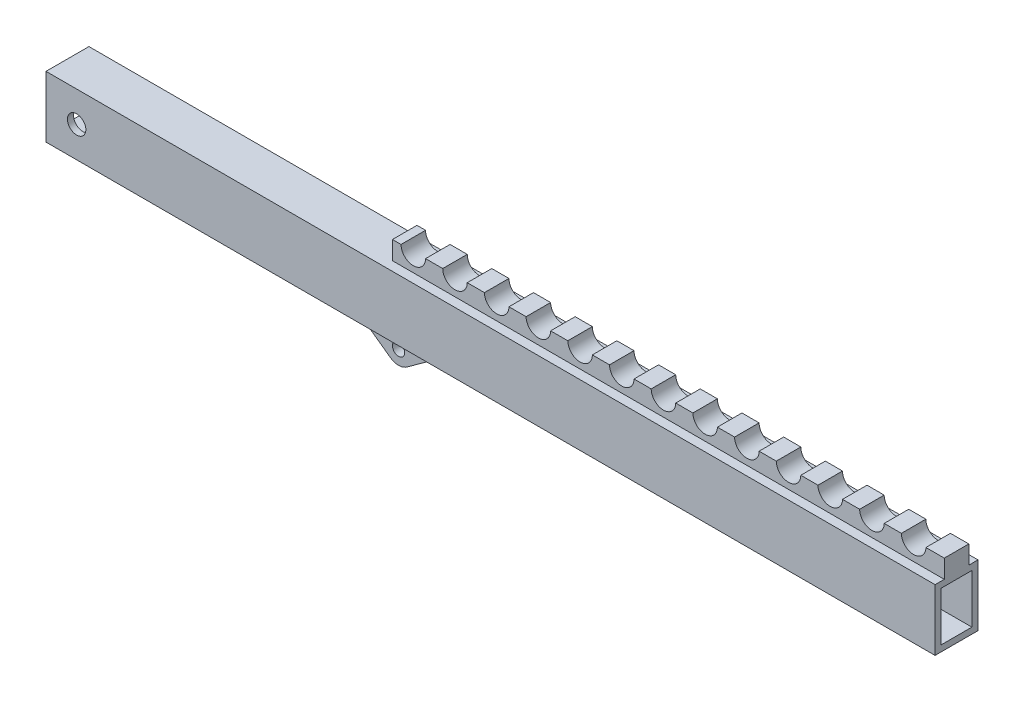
from build123d import *

# Parameters (mm, degrees)
ESQUISSE1_W            = 1450
ESQUISSE1_H            = 100
EXTRUSION1_DEPTH       = 35
COQUE1_T               = -10
ESQUISSE2_R            = 15
PER_AGE_DEPTH          = 1386.712653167
ESQUISSE3_R            = 10
PATTE_INF_RIEURE_DEPTH = 10
EXTRUSION3_DEPTH       = 20


with BuildPart() as part:
    # Esquisse1 → Extrusion1 (new, symmetric)
    with BuildSketch(Plane.XY):
        with Locations((656.120487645, -38.350188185)):
            Rectangle(ESQUISSE1_W, ESQUISSE1_H)
    extrude(amount=EXTRUSION1_DEPTH, both=True)

    # Coque1
    coque1_openings = [part.faces().sort_by_distance(p)[0] for p in [
        (1381.120487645, -38.350188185, 0),
        (-68.879512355, -38.350188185, 0),
    ]]
    offset(amount=COQUE1_T, openings=coque1_openings, kind=Kind.INTERSECTION)

    # Esquisse2 → Per_age (cut, through all)
    with BuildSketch(Plane.XY.offset(35)):
        with Locations((-18.879512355, -38.350188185)):
            Circle(ESQUISSE2_R)
    extrude(amount=-PER_AGE_DEPTH, mode=Mode.SUBTRACT)

    # Esquisse3 → Patte inf_rieure (add, symmetric)
    with BuildSketch(Plane.XY):
        with BuildLine():
            Line((400.47806346, -88.350188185), (561.762911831, -88.350188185))
            Line((561.762911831, -88.350188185), (494.44102233, -136.842927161))
            ThreePointArc((494.44102233, -136.842927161), (481.120487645, -141.140932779), (467.799952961, -136.842927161))
            Line((467.799952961, -136.842927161), (400.47806346, -88.350188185))
        make_face()
        with Locations((481.120487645, -118.350188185)):
            Circle(ESQUISSE3_R, mode=Mode.SUBTRACT)
    extrude(amount=PATTE_INF_RIEURE_DEPTH, both=True)

    # Esquisse4 → Extrusion3 (add, symmetric)
    with BuildSketch(Plane.XY):
        with BuildLine():
            Line((481.120487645, 11.649811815), (1381.120487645, 11.649811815))
            Line((1381.120487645, 11.649811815), (1381.120487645, 41.649811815))
            Line((1381.120487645, 41.649811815), (1351.120487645, 41.649811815))
            ThreePointArc((1351.120487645, 41.649811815), (1331.120487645, 21.649811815), (1311.120487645, 41.649811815))
            Line((1311.120487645, 41.649811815), (1283.120487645, 41.649811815))
            ThreePointArc((1283.120487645, 41.649811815), (1263.120487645, 21.649811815), (1243.120487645, 41.649811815))
            Line((1243.120487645, 41.649811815), (1215.120487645, 41.649811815))
            ThreePointArc((1215.120487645, 41.649811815), (1195.120487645, 21.649811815), (1175.120487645, 41.649811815))
            Line((1175.120487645, 41.649811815), (1147.120487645, 41.649811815))
            ThreePointArc((1147.120487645, 41.649811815), (1127.120487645, 21.649811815), (1107.120487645, 41.649811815))
            Line((1107.120487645, 41.649811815), (1079.120487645, 41.649811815))
            ThreePointArc((1079.120487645, 41.649811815), (1059.120487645, 21.649811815), (1039.120487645, 41.649811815))
            Line((1039.120487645, 41.649811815), (1011.120487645, 41.649811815))
            ThreePointArc((1011.120487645, 41.649811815), (991.120487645, 21.649811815), (971.120487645, 41.649811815))
            Line((971.120487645, 41.649811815), (943.120487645, 41.649811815))
            ThreePointArc((943.120487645, 41.649811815), (923.120487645, 21.649811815), (903.120487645, 41.649811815))
            Line((903.120487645, 41.649811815), (875.120487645, 41.649811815))
            ThreePointArc((875.120487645, 41.649811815), (855.120487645, 21.649811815), (835.120487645, 41.649811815))
            Line((835.120487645, 41.649811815), (807.120487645, 41.649811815))
            ThreePointArc((807.120487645, 41.649811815), (787.120487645, 21.649811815), (767.120487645, 41.649811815))
            Line((767.120487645, 41.649811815), (739.120487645, 41.649811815))
            ThreePointArc((739.120487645, 41.649811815), (719.120487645, 21.649811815), (699.120487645, 41.649811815))
            Line((699.120487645, 41.649811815), (671.120487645, 41.649811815))
            ThreePointArc((671.120487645, 41.649811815), (651.120487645, 21.649811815), (631.120487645, 41.649811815))
            Line((631.120487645, 41.649811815), (603.120487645, 41.649811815))
            ThreePointArc((603.120487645, 41.649811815), (583.120487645, 21.649811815), (563.120487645, 41.649811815))
            Line((563.120487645, 41.649811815), (535.120487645, 41.649811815))
            ThreePointArc((535.120487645, 41.649811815), (515.120487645, 21.649811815), (495.120487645, 41.649811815))
            Line((495.120487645, 41.649811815), (481.120487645, 41.649811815))
            Line((481.120487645, 41.649811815), (481.120487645, 11.649811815))
        make_face()
    extrude(amount=EXTRUSION3_DEPTH, both=True)


solid = part.part
